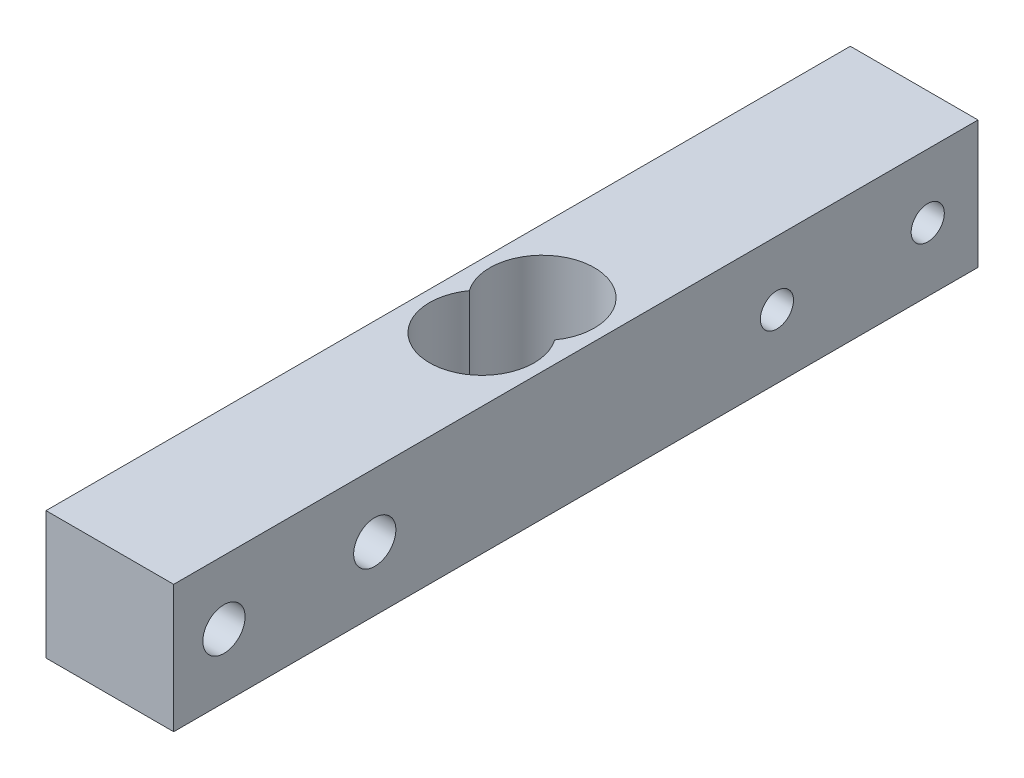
ISO-10303-21;
HEADER;
FILE_DESCRIPTION(('STEP AP214'),'2;1');
FILE_NAME('part.step','',(''),(''),'','','');
FILE_SCHEMA(('AUTOMOTIVE_DESIGN { 1 0 10303 214 1 1 1 1 }'));
ENDSEC;
DATA;
#1=APPLICATION_CONTEXT('core data for automotive mechanical design processes');
#2=APPLICATION_PROTOCOL_DEFINITION('international standard','automotive_design',2000,#1);
#3=PRODUCT_CONTEXT('',#1,'mechanical');
#4=PRODUCT('Part','Part','',(#3));
#5=PRODUCT_RELATED_PRODUCT_CATEGORY('part','',(#4));
#6=PRODUCT_DEFINITION_FORMATION('','',#4);
#7=PRODUCT_DEFINITION_CONTEXT('part definition',#1,'design');
#8=PRODUCT_DEFINITION('design','',#6,#7);
#9=PRODUCT_DEFINITION_SHAPE('','',#8);
#10=(LENGTH_UNIT() NAMED_UNIT(*) SI_UNIT(.MILLI.,.METRE.));
#11=(NAMED_UNIT(*) PLANE_ANGLE_UNIT() SI_UNIT($,.RADIAN.));
#12=(NAMED_UNIT(*) SI_UNIT($,.STERADIAN.) SOLID_ANGLE_UNIT());
#13=UNCERTAINTY_MEASURE_WITH_UNIT(LENGTH_MEASURE(1.E-05),#10,'distance_accuracy_value','');
#14=(GEOMETRIC_REPRESENTATION_CONTEXT(3) GLOBAL_UNCERTAINTY_ASSIGNED_CONTEXT((#13)) GLOBAL_UNIT_ASSIGNED_CONTEXT((#10,
#11,#12)) REPRESENTATION_CONTEXT('',''));
#15=CARTESIAN_POINT('',(0.,0.,0.));
#16=DIRECTION('',(0.,0.,1.));
#17=DIRECTION('',(1.,0.,0.));
#18=AXIS2_PLACEMENT_3D('',#15,#16,#17);
#19=CARTESIAN_POINT('',(0.,0.,80.));
#20=DIRECTION('',(1.,0.,0.));
#21=DIRECTION('',(0.,0.,-1.));
#22=AXIS2_PLACEMENT_3D('',#19,#20,#21);
#23=PLANE('',#22);
#24=CARTESIAN_POINT('',(0.,6.35,20.));
#25=DIRECTION('',(1.,0.,0.));
#26=DIRECTION('',(0.,0.,-1.));
#27=AXIS2_PLACEMENT_3D('',#24,#25,#26);
#28=CIRCLE('',#27,1.65);
#29=CARTESIAN_POINT('',(0.,6.35,18.35));
#30=VERTEX_POINT('',#29);
#31=EDGE_CURVE('E206',#30,#30,#28,.T.);
#32=ORIENTED_EDGE('',*,*,#31,.T.);
#33=EDGE_LOOP('',(#32));
#34=FACE_BOUND('',#33,.T.);
#35=CARTESIAN_POINT('',(0.,6.35,5.));
#36=DIRECTION('',(1.,0.,0.));
#37=DIRECTION('',(0.,0.,-1.));
#38=AXIS2_PLACEMENT_3D('',#35,#36,#37);
#39=CIRCLE('',#38,1.65);
#40=CARTESIAN_POINT('',(0.,6.35,3.35));
#41=VERTEX_POINT('',#40);
#42=EDGE_CURVE('E216',#41,#41,#39,.T.);
#43=ORIENTED_EDGE('',*,*,#42,.T.);
#44=EDGE_LOOP('',(#43));
#45=FACE_BOUND('',#44,.T.);
#46=CARTESIAN_POINT('',(0.,6.35,75.));
#47=DIRECTION('',(1.,0.,0.));
#48=DIRECTION('',(0.,0.,-1.));
#49=AXIS2_PLACEMENT_3D('',#46,#47,#48);
#50=CIRCLE('',#49,2.1);
#51=CARTESIAN_POINT('',(0.,6.35,72.9));
#52=VERTEX_POINT('',#51);
#53=EDGE_CURVE('E222',#52,#52,#50,.T.);
#54=ORIENTED_EDGE('',*,*,#53,.T.);
#55=EDGE_LOOP('',(#54));
#56=FACE_BOUND('',#55,.T.);
#57=CARTESIAN_POINT('',(0.,6.35,60.));
#58=DIRECTION('',(1.,0.,0.));
#59=DIRECTION('',(0.,0.,-1.));
#60=AXIS2_PLACEMENT_3D('',#57,#58,#59);
#61=CIRCLE('',#60,2.1);
#62=CARTESIAN_POINT('',(0.,6.35,57.9));
#63=VERTEX_POINT('',#62);
#64=EDGE_CURVE('E114',#63,#63,#61,.T.);
#65=ORIENTED_EDGE('',*,*,#64,.T.);
#66=EDGE_LOOP('',(#65));
#67=FACE_BOUND('',#66,.T.);
#68=DIRECTION('',(0.,-1.,0.));
#69=VECTOR('',#68,1.);
#70=CARTESIAN_POINT('',(0.,0.,0.));
#71=LINE('',#70,#69);
#72=CARTESIAN_POINT('',(0.,12.7,0.));
#73=VERTEX_POINT('',#72);
#74=CARTESIAN_POINT('',(0.,0.,0.));
#75=VERTEX_POINT('',#74);
#76=EDGE_CURVE('E110',#73,#75,#71,.T.);
#77=ORIENTED_EDGE('',*,*,#76,.T.);
#78=DIRECTION('',(0.,0.,-1.));
#79=VECTOR('',#78,1.);
#80=CARTESIAN_POINT('',(0.,0.,80.));
#81=LINE('',#80,#79);
#82=CARTESIAN_POINT('',(0.,0.,80.));
#83=VERTEX_POINT('',#82);
#84=EDGE_CURVE('E11',#83,#75,#81,.T.);
#85=ORIENTED_EDGE('',*,*,#84,.F.);
#86=DIRECTION('',(0.,-1.,0.));
#87=VECTOR('',#86,1.);
#88=CARTESIAN_POINT('',(0.,0.,80.));
#89=LINE('',#88,#87);
#90=CARTESIAN_POINT('',(0.,12.7,80.));
#91=VERTEX_POINT('',#90);
#92=EDGE_CURVE('E124',#91,#83,#89,.T.);
#93=ORIENTED_EDGE('',*,*,#92,.F.);
#94=DIRECTION('',(0.,0.,-1.));
#95=VECTOR('',#94,1.);
#96=CARTESIAN_POINT('',(0.,12.7,80.));
#97=LINE('',#96,#95);
#98=EDGE_CURVE('E134',#91,#73,#97,.T.);
#99=ORIENTED_EDGE('',*,*,#98,.T.);
#100=EDGE_LOOP('',(#77,#85,#93,#99));
#101=FACE_BOUND('',#100,.T.);
#102=ADVANCED_FACE('F49',(#34,#45,#56,#67,#101),#23,.F.);
#103=CARTESIAN_POINT('',(0.,0.,80.));
#104=DIRECTION('',(0.,1.,0.));
#105=DIRECTION('',(0.,0.,1.));
#106=AXIS2_PLACEMENT_3D('',#103,#104,#105);
#107=PLANE('',#106);
#108=CARTESIAN_POINT('',(6.35,0.,43.));
#109=DIRECTION('',(0.,-1.,0.));
#110=DIRECTION('',(0.,0.,-1.));
#111=AXIS2_PLACEMENT_3D('',#108,#109,#110);
#112=CIRCLE('',#111,5.2);
#113=CARTESIAN_POINT('',(10.5973521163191,0.,40.));
#114=VERTEX_POINT('',#113);
#115=CARTESIAN_POINT('',(2.10264788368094,0.,40.));
#116=VERTEX_POINT('',#115);
#117=EDGE_CURVE('E104',#114,#116,#112,.T.);
#118=ORIENTED_EDGE('',*,*,#117,.F.);
#119=CARTESIAN_POINT('',(6.35,0.,37.));
#120=DIRECTION('',(0.,-1.,0.));
#121=DIRECTION('',(0.,0.,-1.));
#122=AXIS2_PLACEMENT_3D('',#119,#120,#121);
#123=CIRCLE('',#122,5.2);
#124=EDGE_CURVE('E63',#116,#114,#123,.T.);
#125=ORIENTED_EDGE('',*,*,#124,.F.);
#126=EDGE_LOOP('',(#118,#125));
#127=FACE_BOUND('',#126,.T.);
#128=DIRECTION('',(1.,0.,0.));
#129=VECTOR('',#128,1.);
#130=CARTESIAN_POINT('',(0.,0.,0.));
#131=LINE('',#130,#129);
#132=CARTESIAN_POINT('',(12.7,0.,0.));
#133=VERTEX_POINT('',#132);
#134=EDGE_CURVE('E137',#75,#133,#131,.T.);
#135=ORIENTED_EDGE('',*,*,#134,.T.);
#136=DIRECTION('',(0.,0.,-1.));
#137=VECTOR('',#136,1.);
#138=CARTESIAN_POINT('',(12.7,0.,80.));
#139=LINE('',#138,#137);
#140=CARTESIAN_POINT('',(12.7,0.,80.));
#141=VERTEX_POINT('',#140);
#142=EDGE_CURVE('E56',#141,#133,#139,.T.);
#143=ORIENTED_EDGE('',*,*,#142,.F.);
#144=DIRECTION('',(1.,0.,0.));
#145=VECTOR('',#144,1.);
#146=CARTESIAN_POINT('',(0.,0.,80.));
#147=LINE('',#146,#145);
#148=EDGE_CURVE('E127',#83,#141,#147,.T.);
#149=ORIENTED_EDGE('',*,*,#148,.F.);
#150=ORIENTED_EDGE('',*,*,#84,.T.);
#151=EDGE_LOOP('',(#135,#143,#149,#150));
#152=FACE_BOUND('',#151,.T.);
#153=ADVANCED_FACE('F165',(#127,#152),#107,.F.);
#154=CARTESIAN_POINT('',(12.7,0.,80.));
#155=DIRECTION('',(-1.,0.,0.));
#156=DIRECTION('',(0.,0.,1.));
#157=AXIS2_PLACEMENT_3D('',#154,#155,#156);
#158=PLANE('',#157);
#159=CARTESIAN_POINT('',(12.7,6.35,20.));
#160=DIRECTION('',(1.,0.,0.));
#161=DIRECTION('',(0.,0.,-1.));
#162=AXIS2_PLACEMENT_3D('',#159,#160,#161);
#163=CIRCLE('',#162,1.65);
#164=CARTESIAN_POINT('',(12.7,6.35,18.35));
#165=VERTEX_POINT('',#164);
#166=EDGE_CURVE('E209',#165,#165,#163,.T.);
#167=ORIENTED_EDGE('',*,*,#166,.F.);
#168=EDGE_LOOP('',(#167));
#169=FACE_BOUND('',#168,.T.);
#170=CARTESIAN_POINT('',(12.7,6.35,5.));
#171=DIRECTION('',(1.,0.,0.));
#172=DIRECTION('',(0.,0.,-1.));
#173=AXIS2_PLACEMENT_3D('',#170,#171,#172);
#174=CIRCLE('',#173,1.65);
#175=CARTESIAN_POINT('',(12.7,6.35,3.35));
#176=VERTEX_POINT('',#175);
#177=EDGE_CURVE('E211',#176,#176,#174,.T.);
#178=ORIENTED_EDGE('',*,*,#177,.F.);
#179=EDGE_LOOP('',(#178));
#180=FACE_BOUND('',#179,.T.);
#181=CARTESIAN_POINT('',(12.7,6.35,75.));
#182=DIRECTION('',(1.,0.,0.));
#183=DIRECTION('',(0.,0.,-1.));
#184=AXIS2_PLACEMENT_3D('',#181,#182,#183);
#185=CIRCLE('',#184,2.1);
#186=CARTESIAN_POINT('',(12.7,6.35,72.9));
#187=VERTEX_POINT('',#186);
#188=EDGE_CURVE('E219',#187,#187,#185,.T.);
#189=ORIENTED_EDGE('',*,*,#188,.F.);
#190=EDGE_LOOP('',(#189));
#191=FACE_BOUND('',#190,.T.);
#192=CARTESIAN_POINT('',(12.7,6.35,60.));
#193=DIRECTION('',(1.,0.,0.));
#194=DIRECTION('',(0.,0.,-1.));
#195=AXIS2_PLACEMENT_3D('',#192,#193,#194);
#196=CIRCLE('',#195,2.1);
#197=CARTESIAN_POINT('',(12.7,6.35,57.9));
#198=VERTEX_POINT('',#197);
#199=EDGE_CURVE('E118',#198,#198,#196,.T.);
#200=ORIENTED_EDGE('',*,*,#199,.F.);
#201=EDGE_LOOP('',(#200));
#202=FACE_BOUND('',#201,.T.);
#203=DIRECTION('',(0.,1.,0.));
#204=VECTOR('',#203,1.);
#205=CARTESIAN_POINT('',(12.7,0.,0.));
#206=LINE('',#205,#204);
#207=CARTESIAN_POINT('',(12.7,12.7,0.));
#208=VERTEX_POINT('',#207);
#209=EDGE_CURVE('E139',#133,#208,#206,.T.);
#210=ORIENTED_EDGE('',*,*,#209,.T.);
#211=DIRECTION('',(0.,0.,-1.));
#212=VECTOR('',#211,1.);
#213=CARTESIAN_POINT('',(12.7,12.7,80.));
#214=LINE('',#213,#212);
#215=CARTESIAN_POINT('',(12.7,12.7,80.));
#216=VERTEX_POINT('',#215);
#217=EDGE_CURVE('E144',#216,#208,#214,.T.);
#218=ORIENTED_EDGE('',*,*,#217,.F.);
#219=DIRECTION('',(0.,1.,0.));
#220=VECTOR('',#219,1.);
#221=CARTESIAN_POINT('',(12.7,0.,80.));
#222=LINE('',#221,#220);
#223=EDGE_CURVE('E130',#141,#216,#222,.T.);
#224=ORIENTED_EDGE('',*,*,#223,.F.);
#225=ORIENTED_EDGE('',*,*,#142,.T.);
#226=EDGE_LOOP('',(#210,#218,#224,#225));
#227=FACE_BOUND('',#226,.T.);
#228=ADVANCED_FACE('F151',(#169,#180,#191,#202,#227),#158,.F.);
#229=CARTESIAN_POINT('',(0.,12.7,80.));
#230=DIRECTION('',(0.,-1.,0.));
#231=DIRECTION('',(0.,0.,-1.));
#232=AXIS2_PLACEMENT_3D('',#229,#230,#231);
#233=PLANE('',#232);
#234=CARTESIAN_POINT('',(6.35,12.7,43.));
#235=DIRECTION('',(0.,-1.,0.));
#236=DIRECTION('',(0.,0.,-1.));
#237=AXIS2_PLACEMENT_3D('',#234,#235,#236);
#238=CIRCLE('',#237,5.2);
#239=CARTESIAN_POINT('',(2.10264788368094,12.7,40.));
#240=VERTEX_POINT('',#239);
#241=CARTESIAN_POINT('',(10.5973521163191,12.7,40.));
#242=VERTEX_POINT('',#241);
#243=EDGE_CURVE('E107',#240,#242,#238,.F.);
#244=ORIENTED_EDGE('',*,*,#243,.F.);
#245=CARTESIAN_POINT('',(6.35,12.7,37.));
#246=DIRECTION('',(0.,-1.,0.));
#247=DIRECTION('',(0.,0.,-1.));
#248=AXIS2_PLACEMENT_3D('',#245,#246,#247);
#249=CIRCLE('',#248,5.2);
#250=EDGE_CURVE('E68',#242,#240,#249,.F.);
#251=ORIENTED_EDGE('',*,*,#250,.F.);
#252=EDGE_LOOP('',(#244,#251));
#253=FACE_BOUND('',#252,.T.);
#254=DIRECTION('',(-1.,0.,0.));
#255=VECTOR('',#254,1.);
#256=CARTESIAN_POINT('',(0.,12.7,0.));
#257=LINE('',#256,#255);
#258=EDGE_CURVE('E128',#208,#73,#257,.T.);
#259=ORIENTED_EDGE('',*,*,#258,.T.);
#260=ORIENTED_EDGE('',*,*,#98,.F.);
#261=DIRECTION('',(-1.,0.,0.));
#262=VECTOR('',#261,1.);
#263=CARTESIAN_POINT('',(0.,12.7,80.));
#264=LINE('',#263,#262);
#265=EDGE_CURVE('E132',#216,#91,#264,.T.);
#266=ORIENTED_EDGE('',*,*,#265,.F.);
#267=ORIENTED_EDGE('',*,*,#217,.T.);
#268=EDGE_LOOP('',(#259,#260,#266,#267));
#269=FACE_BOUND('',#268,.T.);
#270=ADVANCED_FACE('F112',(#253,#269),#233,.F.);
#271=CARTESIAN_POINT('',(0.,0.,80.));
#272=DIRECTION('',(0.,0.,-1.));
#273=DIRECTION('',(-1.,0.,0.));
#274=AXIS2_PLACEMENT_3D('',#271,#272,#273);
#275=PLANE('',#274);
#276=ORIENTED_EDGE('',*,*,#92,.T.);
#277=ORIENTED_EDGE('',*,*,#148,.T.);
#278=ORIENTED_EDGE('',*,*,#223,.T.);
#279=ORIENTED_EDGE('',*,*,#265,.T.);
#280=EDGE_LOOP('',(#276,#277,#278,#279));
#281=FACE_BOUND('',#280,.T.);
#282=ADVANCED_FACE('F164',(#281),#275,.F.);
#283=CARTESIAN_POINT('',(0.,0.,0.));
#284=DIRECTION('',(0.,0.,-1.));
#285=DIRECTION('',(-1.,0.,0.));
#286=AXIS2_PLACEMENT_3D('',#283,#284,#285);
#287=PLANE('',#286);
#288=ORIENTED_EDGE('',*,*,#76,.F.);
#289=ORIENTED_EDGE('',*,*,#258,.F.);
#290=ORIENTED_EDGE('',*,*,#209,.F.);
#291=ORIENTED_EDGE('',*,*,#134,.F.);
#292=EDGE_LOOP('',(#288,#289,#290,#291));
#293=FACE_BOUND('',#292,.T.);
#294=ADVANCED_FACE('F157',(#293),#287,.T.);
#295=CARTESIAN_POINT('',(6.35,12.701,37.));
#296=DIRECTION('',(0.,-1.,0.));
#297=DIRECTION('',(0.,0.,-1.));
#298=AXIS2_PLACEMENT_3D('',#295,#296,#297);
#299=CYLINDRICAL_SURFACE('',#298,5.2);
#300=ORIENTED_EDGE('',*,*,#250,.T.);
#301=DIRECTION('',(0.,-1.,0.));
#302=VECTOR('',#301,1.);
#303=CARTESIAN_POINT('',(2.10264788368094,12.701,40.));
#304=LINE('',#303,#302);
#305=EDGE_CURVE('E103',#240,#116,#304,.T.);
#306=ORIENTED_EDGE('',*,*,#305,.T.);
#307=ORIENTED_EDGE('',*,*,#124,.T.);
#308=DIRECTION('',(0.,-1.,0.));
#309=VECTOR('',#308,1.);
#310=CARTESIAN_POINT('',(10.5973521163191,12.701,40.));
#311=LINE('',#310,#309);
#312=EDGE_CURVE('E97',#242,#114,#311,.T.);
#313=ORIENTED_EDGE('',*,*,#312,.F.);
#314=EDGE_LOOP('',(#300,#306,#307,#313));
#315=FACE_BOUND('',#314,.T.);
#316=ADVANCED_FACE('F99',(#315),#299,.F.);
#317=CARTESIAN_POINT('',(6.35,12.701,43.));
#318=DIRECTION('',(0.,-1.,0.));
#319=DIRECTION('',(0.,0.,-1.));
#320=AXIS2_PLACEMENT_3D('',#317,#318,#319);
#321=CYLINDRICAL_SURFACE('',#320,5.2);
#322=ORIENTED_EDGE('',*,*,#243,.T.);
#323=ORIENTED_EDGE('',*,*,#312,.T.);
#324=ORIENTED_EDGE('',*,*,#117,.T.);
#325=ORIENTED_EDGE('',*,*,#305,.F.);
#326=EDGE_LOOP('',(#322,#323,#324,#325));
#327=FACE_BOUND('',#326,.T.);
#328=ADVANCED_FACE('F108',(#327),#321,.F.);
#329=CARTESIAN_POINT('',(12.7,6.35,60.));
#330=DIRECTION('',(1.,0.,0.));
#331=DIRECTION('',(0.,0.,-1.));
#332=AXIS2_PLACEMENT_3D('',#329,#330,#331);
#333=CYLINDRICAL_SURFACE('',#332,2.1);
#334=ORIENTED_EDGE('',*,*,#64,.F.);
#335=EDGE_LOOP('',(#334));
#336=FACE_BOUND('',#335,.T.);
#337=ORIENTED_EDGE('',*,*,#199,.T.);
#338=EDGE_LOOP('',(#337));
#339=FACE_BOUND('',#338,.T.);
#340=ADVANCED_FACE('F186',(#336,#339),#333,.F.);
#341=CARTESIAN_POINT('',(12.7,6.35,75.));
#342=DIRECTION('',(1.,0.,0.));
#343=DIRECTION('',(0.,0.,-1.));
#344=AXIS2_PLACEMENT_3D('',#341,#342,#343);
#345=CYLINDRICAL_SURFACE('',#344,2.1);
#346=ORIENTED_EDGE('',*,*,#53,.F.);
#347=EDGE_LOOP('',(#346));
#348=FACE_BOUND('',#347,.T.);
#349=ORIENTED_EDGE('',*,*,#188,.T.);
#350=EDGE_LOOP('',(#349));
#351=FACE_BOUND('',#350,.T.);
#352=ADVANCED_FACE('F189',(#348,#351),#345,.F.);
#353=CARTESIAN_POINT('',(12.7,6.35,5.));
#354=DIRECTION('',(1.,0.,0.));
#355=DIRECTION('',(0.,0.,-1.));
#356=AXIS2_PLACEMENT_3D('',#353,#354,#355);
#357=CYLINDRICAL_SURFACE('',#356,1.65);
#358=ORIENTED_EDGE('',*,*,#42,.F.);
#359=EDGE_LOOP('',(#358));
#360=FACE_BOUND('',#359,.T.);
#361=ORIENTED_EDGE('',*,*,#177,.T.);
#362=EDGE_LOOP('',(#361));
#363=FACE_BOUND('',#362,.T.);
#364=ADVANCED_FACE('F193',(#360,#363),#357,.F.);
#365=CARTESIAN_POINT('',(12.7,6.35,20.));
#366=DIRECTION('',(1.,0.,0.));
#367=DIRECTION('',(0.,0.,-1.));
#368=AXIS2_PLACEMENT_3D('',#365,#366,#367);
#369=CYLINDRICAL_SURFACE('',#368,1.65);
#370=ORIENTED_EDGE('',*,*,#31,.F.);
#371=EDGE_LOOP('',(#370));
#372=FACE_BOUND('',#371,.T.);
#373=ORIENTED_EDGE('',*,*,#166,.T.);
#374=EDGE_LOOP('',(#373));
#375=FACE_BOUND('',#374,.T.);
#376=ADVANCED_FACE('F197',(#372,#375),#369,.F.);
#377=CLOSED_SHELL('',(#102,#153,#228,#270,#282,#294,#316,#328,#340,#352,#364,#376));
#378=MANIFOLD_SOLID_BREP('B2',#377);
#379=ADVANCED_BREP_SHAPE_REPRESENTATION('',(#18,#378),#14);
#380=SHAPE_DEFINITION_REPRESENTATION(#9,#379);
ENDSEC;
END-ISO-10303-21;
